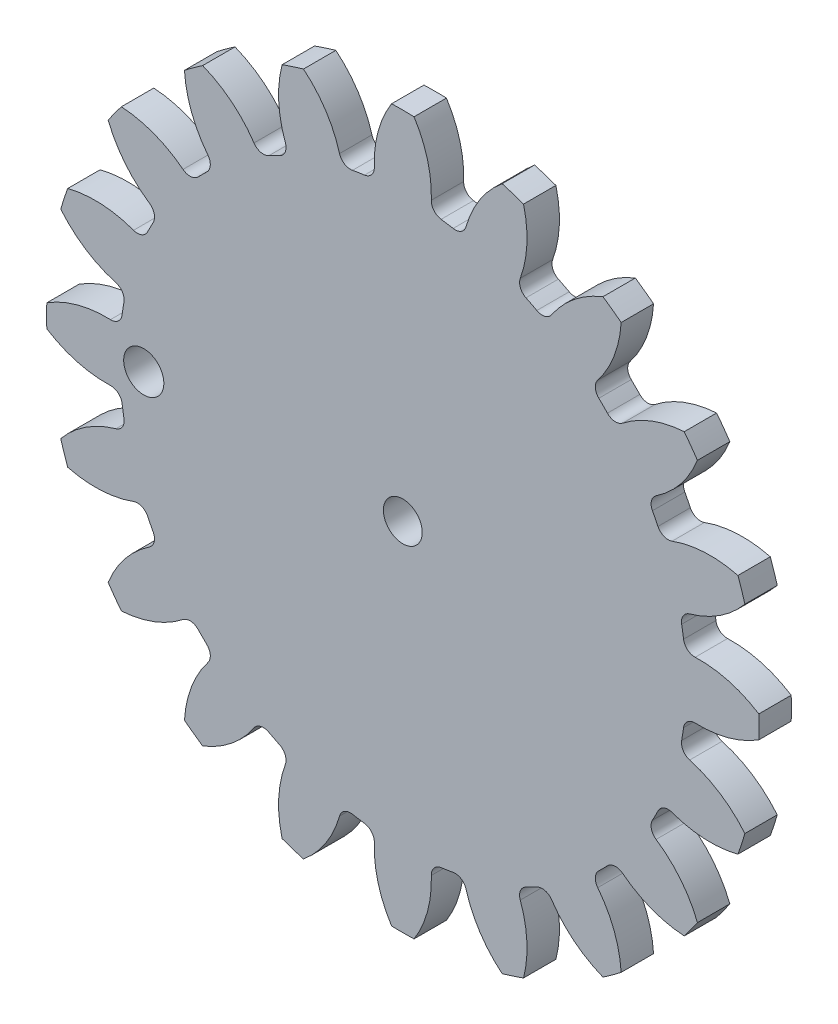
from build123d import *

# Parameters (mm, degrees)
BOSS_EXTRU_1_DEPTH                 = 5
CONG_1_R                           = 1.75
R_P_TITION_CIRCULAIRE4_COUNT       = 20
CONG_1_OF_R_P_TITION_CIRCULAIRE4_R = 1.75
ESQUISSE6_R                        = 3
ENL_V_MAT_EXTRU_1_DEPTH            = 10
ESQUISSE8_R                        = 3.1
ENL_V_MAT_EXTRU_3_DEPTH            = 78.942286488


with BuildPart() as part:
    # Esquisse3 → Boss.-Extru.1 (new body)
    with BuildSketch(Plane.XY):
        with BuildLine():
            Line((-6.844007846, 43.211364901), (0, 0))
            Line((0, 0), (6.844007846, 43.211364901))
            ThreePointArc((6.844007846, 43.211364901), (5.558296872, 43.395481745), (4.267687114, 43.541352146))
            ThreePointArc((4.267687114, 43.541352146), (4.008250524, 49.47966893), (1.736911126, 54.972567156))
            ThreePointArc((1.736911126, 54.972567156), (0, 55), (-1.736911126, 54.972567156))
            ThreePointArc((-1.736911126, 54.972567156), (-4.008250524, 49.47966893), (-4.267687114, 43.541352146))
            ThreePointArc((-4.267687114, 43.541352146), (-5.558296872, 43.395481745), (-6.844007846, 43.211364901))
        make_face()
    boss_extru_1 = extrude(amount=BOSS_EXTRU_1_DEPTH)

    # Cong_1
    cong_1_edges = [part.edges().sort_by_distance(p)[0] for p in [
        (-4.267687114, 43.541352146, 2.5),
        (4.267687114, 43.541352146, 2.5),
    ]]
    fillet(cong_1_edges, radius=CONG_1_R)

    # R_p_tition circulaire4: Boss.-Extru.1 ×20 about axis
    r_p_tition_circulaire4_axis = Axis((0, 0, 0), (0, 0, 1))
    for i in range(1, R_P_TITION_CIRCULAIRE4_COUNT):
        add(boss_extru_1.rotate(r_p_tition_circulaire4_axis, i * 360 / R_P_TITION_CIRCULAIRE4_COUNT))

    # Cong_1 of R_p_tition circulaire4
    cong_1_of_r_p_tition_circulaire4_edges = [part.edges().sort_by_distance(p)[0] for p in [
        (-17.513829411, 40.091498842, 2.5),
        (-9.396206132, 42.729074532, 2.5),
        (-29.045596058, 32.717210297, 2.5),
        (-22.140333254, 37.734177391, 2.5),
        (-37.734177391, 22.140333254, 2.5),
        (-32.717210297, 29.045596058, 2.5),
        (-42.729074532, 9.396206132, 2.5),
        (-40.091498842, 17.513829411, 2.5),
        (-43.541352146, -4.267687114, 2.5),
        (-43.541352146, 4.267687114, 2.5),
        (-40.091498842, -17.513829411, 2.5),
        (-42.729074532, -9.396206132, 2.5),
        (-32.717210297, -29.045596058, 2.5),
        (-37.734177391, -22.140333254, 2.5),
        (-22.140333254, -37.734177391, 2.5),
        (-29.045596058, -32.717210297, 2.5),
        (-9.396206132, -42.729074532, 2.5),
        (-17.513829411, -40.091498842, 2.5),
        (4.267687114, -43.541352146, 2.5),
        (-4.267687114, -43.541352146, 2.5),
        (17.513829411, -40.091498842, 2.5),
        (9.396206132, -42.729074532, 2.5),
        (29.045596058, -32.717210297, 2.5),
        (22.140333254, -37.734177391, 2.5),
        (37.734177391, -22.140333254, 2.5),
        (32.717210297, -29.045596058, 2.5),
        (42.729074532, -9.396206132, 2.5),
        (40.091498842, -17.513829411, 2.5),
        (43.541352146, 4.267687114, 2.5),
        (43.541352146, -4.267687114, 2.5),
        (40.091498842, 17.513829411, 2.5),
        (42.729074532, 9.396206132, 2.5),
        (32.717210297, 29.045596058, 2.5),
        (37.734177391, 22.140333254, 2.5),
        (22.140333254, 37.734177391, 2.5),
        (29.045596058, 32.717210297, 2.5),
        (9.396206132, 42.729074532, 2.5),
        (17.513829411, 40.091498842, 2.5),
    ]]
    fillet(cong_1_of_r_p_tition_circulaire4_edges, radius=CONG_1_OF_R_P_TITION_CIRCULAIRE4_R)

    # Esquisse6 → Enl_v. mat.-Extru.1 (cut)
    with BuildSketch(Plane.XY.offset(5)):
        Circle(ESQUISSE6_R)
    extrude(amount=-ENL_V_MAT_EXTRU_1_DEPTH, mode=Mode.SUBTRACT)

    # Esquisse8 → Enl_v. mat.-Extru.3 (cut, through all)
    with BuildSketch(Plane.XY.offset(5)):
        with Locations((-40, 0)):
            Circle(ESQUISSE8_R)
    extrude(amount=-ENL_V_MAT_EXTRU_3_DEPTH, mode=Mode.SUBTRACT)


solid = part.part
